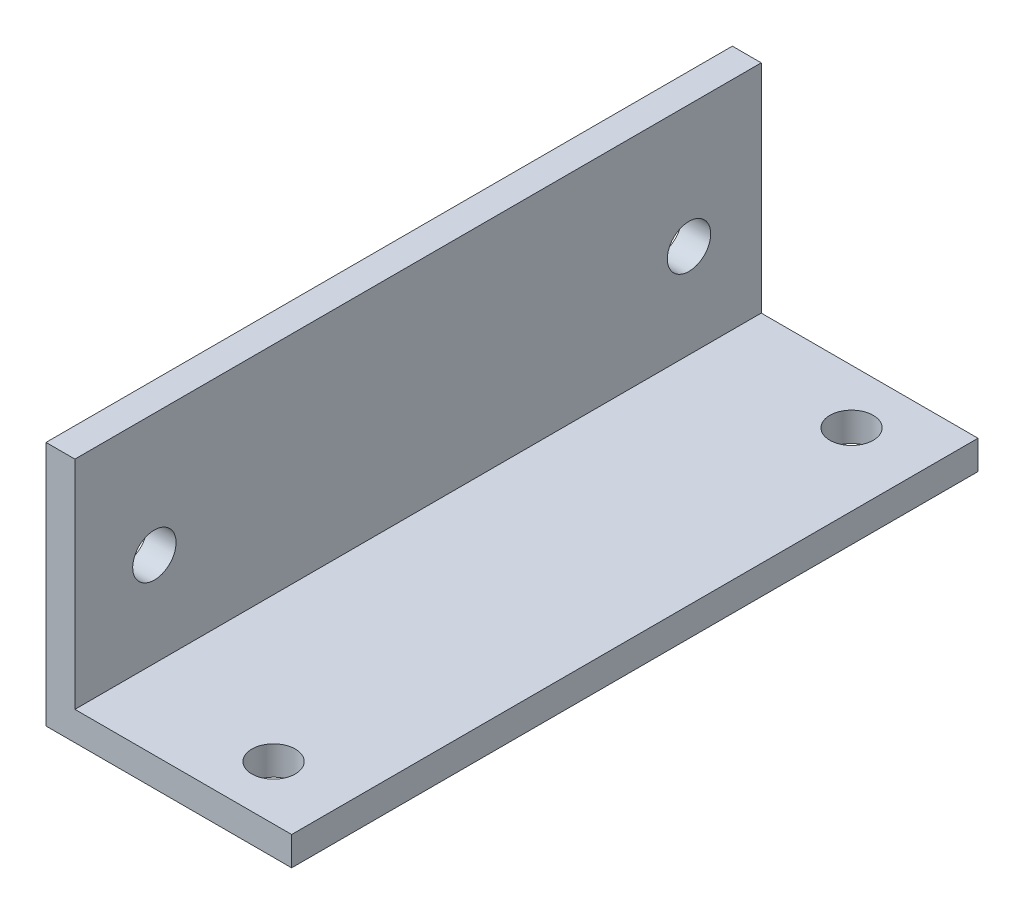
from build123d import *

# Parameters (mm, degrees)
EXTRUDE_1_DEPTH     = 125
SKETCH_3_R          = 1.5
CUT_EXTRUDE_3_DEPTH = 30
CUT_EXTRUDE_4_DEPTH = 74
SKETCH_6_R          = 1.5
CUT_EXTRUDE_5_DEPTH = 10


with BuildPart() as part:
    # Sketch 1 → Extrude 1 (new body)
    with BuildSketch(Plane.XY):
        Polygon((0, 17), (0, 0), (17, 0), (17, 2), (2, 2), (2, 17), align=None)
    extrude(amount=EXTRUDE_1_DEPTH)

    # Sketch 3 → Cut-Extrude 3 (cut)
    with BuildSketch(Plane.ZY):
        with Locations(Location((5, 8.5, 0), (0, 0, 270))):
            Circle(SKETCH_3_R)
        with Locations(Location((42, 8.5, 0), (0, 0, 270))):
            Circle(SKETCH_3_R)
        with Locations(Location((83, 8.5, 0), (0, 0, 270))):
            Circle(SKETCH_3_R)
        with Locations(Location((120, 8.5, 0), (0, 0, 270))):
            Circle(SKETCH_3_R)
    extrude(amount=-CUT_EXTRUDE_3_DEPTH, mode=Mode.SUBTRACT)

    # Sketch 5 → Cut-Extrude 4 (cut)
    with BuildSketch(Plane.ZY):
        Polygon((47.5, 17), (47.5, 0), (134.043614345, 0), (138.335564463, 27.95393983), align=None)
    extrude(amount=-CUT_EXTRUDE_4_DEPTH, mode=Mode.SUBTRACT)

    # Sketch 6 → Cut-Extrude 5 (cut)
    with BuildSketch(Plane(origin=(0, 2, 0), x_dir=(1, 0, 0), z_dir=(0, 1, 0))):
        with Locations(Location((12, -3.75, 0), (0, 0, 180))):
            Circle(SKETCH_6_R)
        with Locations(Location((12, -43.75, 0), (0, 0, 270))):
            Circle(SKETCH_6_R)
    extrude(amount=-CUT_EXTRUDE_5_DEPTH, mode=Mode.SUBTRACT)


solid = part.part
